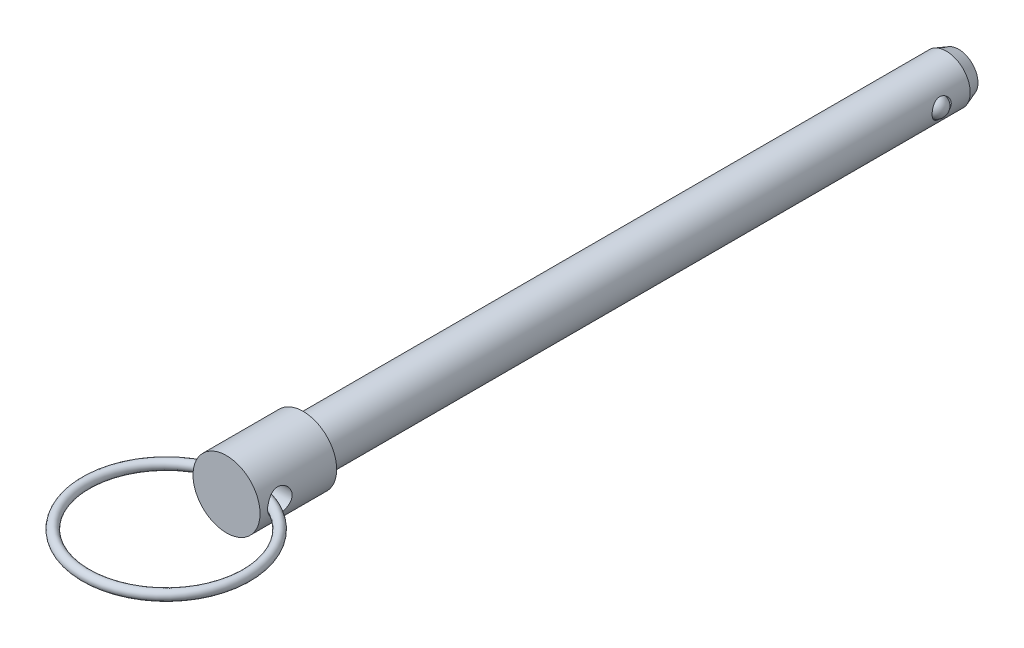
ISO-10303-21;
HEADER;
FILE_DESCRIPTION(('STEP AP214'),'2;1');
FILE_NAME('part.step','',(''),(''),'','','');
FILE_SCHEMA(('AUTOMOTIVE_DESIGN { 1 0 10303 214 1 1 1 1 }'));
ENDSEC;
DATA;
#1=APPLICATION_CONTEXT('core data for automotive mechanical design processes');
#2=APPLICATION_PROTOCOL_DEFINITION('international standard','automotive_design',2000,#1);
#3=PRODUCT_CONTEXT('',#1,'mechanical');
#4=PRODUCT('Part','Part','',(#3));
#5=PRODUCT_RELATED_PRODUCT_CATEGORY('part','',(#4));
#6=PRODUCT_DEFINITION_FORMATION('','',#4);
#7=PRODUCT_DEFINITION_CONTEXT('part definition',#1,'design');
#8=PRODUCT_DEFINITION('design','',#6,#7);
#9=PRODUCT_DEFINITION_SHAPE('','',#8);
#10=(LENGTH_UNIT() NAMED_UNIT(*) SI_UNIT(.MILLI.,.METRE.));
#11=(NAMED_UNIT(*) PLANE_ANGLE_UNIT() SI_UNIT($,.RADIAN.));
#12=(NAMED_UNIT(*) SI_UNIT($,.STERADIAN.) SOLID_ANGLE_UNIT());
#13=UNCERTAINTY_MEASURE_WITH_UNIT(LENGTH_MEASURE(1.E-05),#10,'distance_accuracy_value','');
#14=(GEOMETRIC_REPRESENTATION_CONTEXT(3) GLOBAL_UNCERTAINTY_ASSIGNED_CONTEXT((#13)) GLOBAL_UNIT_ASSIGNED_CONTEXT((#10,
#11,#12)) REPRESENTATION_CONTEXT('',''));
#15=CARTESIAN_POINT('',(0.,0.,0.));
#16=DIRECTION('',(0.,0.,1.));
#17=DIRECTION('',(1.,0.,0.));
#18=AXIS2_PLACEMENT_3D('',#15,#16,#17);
#19=CARTESIAN_POINT('',(7.9375,0.,9.398));
#20=DIRECTION('',(-1.,0.,0.));
#21=DIRECTION('',(0.,0.,-1.));
#22=AXIS2_PLACEMENT_3D('',#19,#20,#21);
#23=CYLINDRICAL_SURFACE('',#22,2.0193);
#24=CARTESIAN_POINT('',(-5.55645,0.413388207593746,11.3745329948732));
#25=CARTESIAN_POINT('',(-5.53323669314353,0.388835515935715,11.3796705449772));
#26=CARTESIAN_POINT('',(-5.51157389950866,0.362641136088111,11.3846690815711));
#27=CARTESIAN_POINT('',(-5.47216390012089,0.307044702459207,11.3940198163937));
#28=CARTESIAN_POINT('',(-5.45444977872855,0.277618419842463,11.3983664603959));
#29=CARTESIAN_POINT('',(-5.42406600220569,0.215851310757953,11.4059720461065));
#30=CARTESIAN_POINT('',(-5.41142802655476,0.18349367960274,11.4092241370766));
#31=CARTESIAN_POINT('',(-5.39235124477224,0.116986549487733,11.4141821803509));
#32=CARTESIAN_POINT('',(-5.38588919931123,0.0828442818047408,11.4158939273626));
#33=CARTESIAN_POINT('',(-5.37995615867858,0.0172985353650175,11.4174656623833));
#34=CARTESIAN_POINT('',(-5.37986165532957,-0.0140451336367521,11.4174908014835));
#35=CARTESIAN_POINT('',(-5.38511249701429,-0.0762532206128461,11.4160995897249));
#36=CARTESIAN_POINT('',(-5.3904604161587,-0.107117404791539,11.4146825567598));
#37=CARTESIAN_POINT('',(-5.40574321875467,-0.165640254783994,11.4106965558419));
#38=CARTESIAN_POINT('',(-5.41539031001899,-0.193380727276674,11.408200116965));
#39=CARTESIAN_POINT('',(-5.4386285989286,-0.247073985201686,11.4023097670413));
#40=CARTESIAN_POINT('',(-5.4522239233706,-0.273024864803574,11.398914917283));
#41=CARTESIAN_POINT('',(-5.48024922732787,-0.318737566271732,11.3920973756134));
#42=CARTESIAN_POINT('',(-5.49418727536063,-0.338820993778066,11.3887682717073));
#43=CARTESIAN_POINT('',(-5.52397071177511,-0.377330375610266,11.3818282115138));
#44=CARTESIAN_POINT('',(-5.53980753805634,-0.395763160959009,11.378218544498));
#45=CARTESIAN_POINT('',(-5.55645,-0.41338820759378,11.3745329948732));
#46=B_SPLINE_CURVE_WITH_KNOTS('',3,(#24,#25,#26,#27,#28,#29,#30,#31,#32,#33,#34,#35,#36,#37,#38,
#39,#40,#41,#42,#43,#44,#45),.UNSPECIFIED.,.F.,.F.,(4,2,2,2,2,2,2,2,2,2,4),(0.,
0.102621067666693,0.206072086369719,0.31015905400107,0.413852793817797,0.507376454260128,
0.600944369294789,0.689017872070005,0.777183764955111,0.851068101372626,0.924630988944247),.UNSPECIFIED.);
#47=CARTESIAN_POINT('',(-5.54200209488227,0.397651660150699,11.3777589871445));
#48=VERTEX_POINT('',#47);
#49=CARTESIAN_POINT('',(-5.54200209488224,-0.397651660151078,11.3777589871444));
#50=VERTEX_POINT('',#49);
#51=EDGE_CURVE('E40',#48,#50,#46,.T.);
#52=ORIENTED_EDGE('',*,*,#51,.F.);
#53=CARTESIAN_POINT('',(-5.55625,0.,11.4173));
#54=CARTESIAN_POINT('',(-5.55624527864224,-0.109432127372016,11.4172937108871));
#55=CARTESIAN_POINT('',(-5.55298237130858,-0.218969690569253,11.408361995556));
#56=CARTESIAN_POINT('',(-5.54026368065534,-0.434902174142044,11.372953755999));
#57=CARTESIAN_POINT('',(-5.53079819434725,-0.541291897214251,11.3464497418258));
#58=CARTESIAN_POINT('',(-5.50670156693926,-0.747605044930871,11.2769560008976));
#59=CARTESIAN_POINT('',(-5.49208344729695,-0.847544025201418,11.2340078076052));
#60=CARTESIAN_POINT('',(-5.45915039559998,-1.0387575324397,11.1330083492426));
#61=CARTESIAN_POINT('',(-5.44083572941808,-1.13003268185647,11.0749581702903));
#62=CARTESIAN_POINT('',(-5.4015811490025,-1.3050572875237,10.9429422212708));
#63=CARTESIAN_POINT('',(-5.38056990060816,-1.38841141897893,10.8684736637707));
#64=CARTESIAN_POINT('',(-5.33865236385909,-1.54176439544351,10.7067995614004));
#65=CARTESIAN_POINT('',(-5.31774611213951,-1.6117588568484,10.6195898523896));
#66=CARTESIAN_POINT('',(-5.27759352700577,-1.73882919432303,10.4311528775));
#67=CARTESIAN_POINT('',(-5.25843183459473,-1.79536185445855,10.3295394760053));
#68=CARTESIAN_POINT('',(-5.22503611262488,-1.89036141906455,10.1174402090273));
#69=CARTESIAN_POINT('',(-5.21080023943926,-1.92883508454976,10.0069576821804));
#70=CARTESIAN_POINT('',(-5.18962447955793,-1.98509166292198,9.78477737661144));
#71=CARTESIAN_POINT('',(-5.18242178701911,-2.00362275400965,9.67329490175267));
#72=CARTESIAN_POINT('',(-5.17535625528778,-2.02180769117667,9.44858805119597));
#73=CARTESIAN_POINT('',(-5.17549061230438,-2.02146874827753,9.33536435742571));
#74=CARTESIAN_POINT('',(-5.18285629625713,-2.00249790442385,9.11709454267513));
#75=CARTESIAN_POINT('',(-5.18969215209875,-1.98488533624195,9.01194405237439));
#76=CARTESIAN_POINT('',(-5.2090363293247,-1.93354575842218,8.80620743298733));
#77=CARTESIAN_POINT('',(-5.22154547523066,-1.89981640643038,8.70562196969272));
#78=CARTESIAN_POINT('',(-5.25107746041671,-1.81661001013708,8.50972358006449));
#79=CARTESIAN_POINT('',(-5.26817827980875,-1.76685762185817,8.41453987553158));
#80=CARTESIAN_POINT('',(-5.30493780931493,-1.65321144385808,8.23357336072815));
#81=CARTESIAN_POINT('',(-5.32459724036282,-1.58931366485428,8.14779321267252));
#82=CARTESIAN_POINT('',(-5.36576425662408,-1.44447059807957,7.98240722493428));
#83=CARTESIAN_POINT('',(-5.38731044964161,-1.36270785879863,7.90352531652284));
#84=CARTESIAN_POINT('',(-5.42876622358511,-1.18682967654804,7.76035905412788));
#85=CARTESIAN_POINT('',(-5.44867505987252,-1.09270866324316,7.69608131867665));
#86=CARTESIAN_POINT('',(-5.48497084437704,-0.893001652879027,7.58320896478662));
#87=CARTESIAN_POINT('',(-5.5013029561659,-0.787270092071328,7.53485348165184));
#88=CARTESIAN_POINT('',(-5.52817729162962,-0.568540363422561,7.45692936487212));
#89=CARTESIAN_POINT('',(-5.53873126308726,-0.455557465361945,7.42732259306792));
#90=CARTESIAN_POINT('',(-5.54924569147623,-0.284581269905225,7.39803699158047));
#91=CARTESIAN_POINT('',(-5.5518636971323,-0.227949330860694,7.3907957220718));
#92=CARTESIAN_POINT('',(-5.55536708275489,-0.114221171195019,7.3811255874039));
#93=CARTESIAN_POINT('',(-5.55625246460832,-0.0571249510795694,7.37869671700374));
#94=CARTESIAN_POINT('',(-5.55624527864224,0.109432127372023,7.37870628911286));
#95=CARTESIAN_POINT('',(-5.55298237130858,0.218969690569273,7.38763800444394));
#96=CARTESIAN_POINT('',(-5.54026368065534,0.434902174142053,7.42304624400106));
#97=CARTESIAN_POINT('',(-5.53079819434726,0.541291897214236,7.44955025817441));
#98=CARTESIAN_POINT('',(-5.50670156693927,0.747605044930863,7.51904399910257));
#99=CARTESIAN_POINT('',(-5.49208344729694,0.84754402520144,7.56199219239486));
#100=CARTESIAN_POINT('',(-5.45915039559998,1.03875753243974,7.66299165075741));
#101=CARTESIAN_POINT('',(-5.44083572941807,1.13003268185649,7.72104182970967));
#102=CARTESIAN_POINT('',(-5.40158114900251,1.30505728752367,7.85305777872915));
#103=CARTESIAN_POINT('',(-5.38056990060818,1.38841141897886,7.92752633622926));
#104=CARTESIAN_POINT('',(-5.3386523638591,1.54176439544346,8.0892004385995));
#105=CARTESIAN_POINT('',(-5.31774611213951,1.61175885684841,8.17641014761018));
#106=CARTESIAN_POINT('',(-5.27759352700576,1.73882919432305,8.36484712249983));
#107=CARTESIAN_POINT('',(-5.25843183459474,1.79536185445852,8.46646052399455));
#108=CARTESIAN_POINT('',(-5.22503611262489,1.8903614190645,8.67855979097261));
#109=CARTESIAN_POINT('',(-5.21080023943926,1.92883508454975,8.78904231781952));
#110=CARTESIAN_POINT('',(-5.18962447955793,1.98509166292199,9.01122262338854));
#111=CARTESIAN_POINT('',(-5.18242178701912,2.00362275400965,9.12270509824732));
#112=CARTESIAN_POINT('',(-5.17535625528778,2.02180769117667,9.34741194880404));
#113=CARTESIAN_POINT('',(-5.17549061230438,2.02146874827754,9.4606356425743));
#114=CARTESIAN_POINT('',(-5.18285629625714,2.00249790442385,9.67890545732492));
#115=CARTESIAN_POINT('',(-5.18969215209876,1.98488533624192,9.78405594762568));
#116=CARTESIAN_POINT('',(-5.20903632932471,1.93354575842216,9.9897925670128));
#117=CARTESIAN_POINT('',(-5.22154547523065,1.8998164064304,10.0903780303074));
#118=CARTESIAN_POINT('',(-5.25107746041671,1.81661001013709,10.2862764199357));
#119=CARTESIAN_POINT('',(-5.26817827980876,1.76685762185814,10.3814601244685));
#120=CARTESIAN_POINT('',(-5.30493780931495,1.65321144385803,10.5624266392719));
#121=CARTESIAN_POINT('',(-5.32459724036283,1.58931366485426,10.6482067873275));
#122=CARTESIAN_POINT('',(-5.36576425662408,1.44447059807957,10.8135927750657));
#123=CARTESIAN_POINT('',(-5.38731044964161,1.36270785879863,10.8924746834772));
#124=CARTESIAN_POINT('',(-5.42876622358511,1.18682967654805,11.0356409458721));
#125=CARTESIAN_POINT('',(-5.44867505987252,1.09270866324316,11.0999186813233));
#126=CARTESIAN_POINT('',(-5.48497084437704,0.893001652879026,11.2127910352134));
#127=CARTESIAN_POINT('',(-5.5013029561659,0.787270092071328,11.2611465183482));
#128=CARTESIAN_POINT('',(-5.52817729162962,0.568540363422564,11.3390706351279));
#129=CARTESIAN_POINT('',(-5.53873126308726,0.455557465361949,11.3686774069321));
#130=CARTESIAN_POINT('',(-5.54924569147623,0.284581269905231,11.3979630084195));
#131=CARTESIAN_POINT('',(-5.5518636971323,0.227949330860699,11.4052042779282));
#132=CARTESIAN_POINT('',(-5.55536708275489,0.114221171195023,11.4148744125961));
#133=CARTESIAN_POINT('',(-5.55625246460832,0.0571249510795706,11.4173032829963));
#134=CARTESIAN_POINT('',(-5.55625,0.,11.4173));
#135=B_SPLINE_CURVE_WITH_KNOTS('',3,(#53,#54,#55,#56,#57,#58,#59,#60,#61,#62,#63,#64,#65,#66,
#67,#68,#69,#70,#71,#72,#73,#74,#75,#76,#77,#78,#79,#80,#81,#82,#83,#84,#85,#86,#87,#88,#89,#90,
#91,#92,#93,#94,#95,#96,#97,#98,#99,#100,#101,#102,#103,#104,#105,#106,#107,#108,#109,#110,#111,
#112,#113,#114,#115,#116,#117,#118,#119,#120,#121,#122,#123,#124,#125,#126,#127,#128,#129,#130,
#131,#132,#133,#134),.UNSPECIFIED.,.T.,.F.,(4,2,2,2,2,2,2,2,2,2,2,2,2,2,2,2,2,2,2,2,2,2,2,2,2,2,
2,2,2,2,2,2,2,2,2,2,2,2,2,2,4),(0.,0.328075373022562,0.656665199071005,0.984430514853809,
1.31217226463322,1.65185430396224,1.99164760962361,2.34343505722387,2.69509069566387,
3.0330365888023,3.3708533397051,3.68986542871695,4.00892389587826,4.3337872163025,
4.65874227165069,5.00406386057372,5.34954163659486,5.69999369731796,6.04973056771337,
6.22099023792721,6.39224972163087,6.72032509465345,7.04891492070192,7.37668023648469,
7.70442198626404,8.044104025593,8.38389733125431,8.73568477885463,9.08734041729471,
9.42528631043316,9.76310306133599,10.0821151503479,10.4011736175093,10.7260369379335,
11.0509919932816,11.3963135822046,11.7417913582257,12.0922434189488,12.4419802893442,
12.6132399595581,12.7844994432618),.UNSPECIFIED.);
#136=EDGE_CURVE('E66',#50,#48,#135,.T.);
#137=ORIENTED_EDGE('',*,*,#136,.F.);
#138=EDGE_LOOP('',(#52,#137));
#139=FACE_BOUND('',#138,.T.);
#140=CARTESIAN_POINT('',(5.55645,-0.413388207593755,11.3745329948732));
#141=CARTESIAN_POINT('',(5.53323669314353,-0.388835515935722,11.3796705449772));
#142=CARTESIAN_POINT('',(5.51157389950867,-0.362641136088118,11.3846690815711));
#143=CARTESIAN_POINT('',(5.47216390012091,-0.307044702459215,11.3940198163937));
#144=CARTESIAN_POINT('',(5.45444977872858,-0.277618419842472,11.3983664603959));
#145=CARTESIAN_POINT('',(5.42406600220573,-0.215851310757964,11.4059720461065));
#146=CARTESIAN_POINT('',(5.41142802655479,-0.183493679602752,11.4092241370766));
#147=CARTESIAN_POINT('',(5.39235124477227,-0.116986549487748,11.4141821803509));
#148=CARTESIAN_POINT('',(5.38588919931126,-0.0828442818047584,11.4158939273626));
#149=CARTESIAN_POINT('',(5.37995615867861,-0.0172985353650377,11.4174656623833));
#150=CARTESIAN_POINT('',(5.3798616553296,0.0140451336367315,11.4174908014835));
#151=CARTESIAN_POINT('',(5.38511249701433,0.0762532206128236,11.4160995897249));
#152=CARTESIAN_POINT('',(5.39046041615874,0.107117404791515,11.4146825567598));
#153=CARTESIAN_POINT('',(5.40574321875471,0.16564025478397,11.4106965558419));
#154=CARTESIAN_POINT('',(5.41539031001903,0.193380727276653,11.408200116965));
#155=CARTESIAN_POINT('',(5.43862859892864,0.247073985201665,11.4023097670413));
#156=CARTESIAN_POINT('',(5.45222392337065,0.273024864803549,11.398914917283));
#157=CARTESIAN_POINT('',(5.48024922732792,0.3187375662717,11.3920973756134));
#158=CARTESIAN_POINT('',(5.49418727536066,0.33882099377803,11.3887682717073));
#159=CARTESIAN_POINT('',(5.52397071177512,0.37733037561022,11.3818282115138));
#160=CARTESIAN_POINT('',(5.53980753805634,0.395763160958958,11.378218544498));
#161=CARTESIAN_POINT('',(5.55645,0.413388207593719,11.3745329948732));
#162=B_SPLINE_CURVE_WITH_KNOTS('',3,(#140,#141,#142,#143,#144,#145,#146,#147,#148,#149,#150,
#151,#152,#153,#154,#155,#156,#157,#158,#159,#160,#161),.UNSPECIFIED.,.F.,.F.,(4,2,2,2,2,2,2,2,
2,2,4),(0.,0.102621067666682,0.2060720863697,0.310159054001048,0.413852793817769,
0.507376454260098,0.600944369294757,0.689017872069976,0.777183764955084,0.85106810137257,
0.924630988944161),.UNSPECIFIED.);
#163=CARTESIAN_POINT('',(5.54200209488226,-0.397651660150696,11.3777589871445));
#164=VERTEX_POINT('',#163);
#165=CARTESIAN_POINT('',(5.54200209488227,0.397651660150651,11.3777589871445));
#166=VERTEX_POINT('',#165);
#167=EDGE_CURVE('E33',#164,#166,#162,.T.);
#168=ORIENTED_EDGE('',*,*,#167,.F.);
#169=CARTESIAN_POINT('',(5.55625,0.,7.3787));
#170=CARTESIAN_POINT('',(5.55624527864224,-0.10943212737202,7.37870628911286));
#171=CARTESIAN_POINT('',(5.55298237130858,-0.218969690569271,7.38763800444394));
#172=CARTESIAN_POINT('',(5.54026368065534,-0.434902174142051,7.42304624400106));
#173=CARTESIAN_POINT('',(5.53079819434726,-0.541291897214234,7.44955025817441));
#174=CARTESIAN_POINT('',(5.50670156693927,-0.747605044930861,7.51904399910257));
#175=CARTESIAN_POINT('',(5.49208344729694,-0.847544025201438,7.56199219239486));
#176=CARTESIAN_POINT('',(5.45915039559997,-1.03875753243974,7.66299165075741));
#177=CARTESIAN_POINT('',(5.44083572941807,-1.13003268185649,7.72104182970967));
#178=CARTESIAN_POINT('',(5.40158114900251,-1.30505728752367,7.85305777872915));
#179=CARTESIAN_POINT('',(5.38056990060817,-1.38841141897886,7.92752633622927));
#180=CARTESIAN_POINT('',(5.3386523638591,-1.54176439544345,8.0892004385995));
#181=CARTESIAN_POINT('',(5.31774611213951,-1.61175885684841,8.17641014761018));
#182=CARTESIAN_POINT('',(5.27759352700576,-1.73882919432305,8.36484712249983));
#183=CARTESIAN_POINT('',(5.25843183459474,-1.79536185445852,8.46646052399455));
#184=CARTESIAN_POINT('',(5.22503611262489,-1.8903614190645,8.67855979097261));
#185=CARTESIAN_POINT('',(5.21080023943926,-1.92883508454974,8.78904231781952));
#186=CARTESIAN_POINT('',(5.18962447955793,-1.98509166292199,9.01122262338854));
#187=CARTESIAN_POINT('',(5.18242178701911,-2.00362275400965,9.12270509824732));
#188=CARTESIAN_POINT('',(5.17535625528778,-2.02180769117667,9.34741194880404));
#189=CARTESIAN_POINT('',(5.17549061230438,-2.02146874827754,9.4606356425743));
#190=CARTESIAN_POINT('',(5.18285629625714,-2.00249790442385,9.67890545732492));
#191=CARTESIAN_POINT('',(5.18969215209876,-1.98488533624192,9.78405594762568));
#192=CARTESIAN_POINT('',(5.20903632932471,-1.93354575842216,9.9897925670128));
#193=CARTESIAN_POINT('',(5.22154547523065,-1.8998164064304,10.0903780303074));
#194=CARTESIAN_POINT('',(5.25107746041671,-1.81661001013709,10.2862764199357));
#195=CARTESIAN_POINT('',(5.26817827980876,-1.76685762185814,10.3814601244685));
#196=CARTESIAN_POINT('',(5.30493780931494,-1.65321144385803,10.5624266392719));
#197=CARTESIAN_POINT('',(5.32459724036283,-1.58931366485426,10.6482067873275));
#198=CARTESIAN_POINT('',(5.36576425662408,-1.44447059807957,10.8135927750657));
#199=CARTESIAN_POINT('',(5.38731044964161,-1.36270785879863,10.8924746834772));
#200=CARTESIAN_POINT('',(5.42876622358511,-1.18682967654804,11.0356409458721));
#201=CARTESIAN_POINT('',(5.44867505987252,-1.09270866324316,11.0999186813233));
#202=CARTESIAN_POINT('',(5.48497084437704,-0.893001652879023,11.2127910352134));
#203=CARTESIAN_POINT('',(5.50130295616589,-0.787270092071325,11.2611465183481));
#204=CARTESIAN_POINT('',(5.52817729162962,-0.568540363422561,11.3390706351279));
#205=CARTESIAN_POINT('',(5.53873126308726,-0.455557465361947,11.3686774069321));
#206=CARTESIAN_POINT('',(5.54924569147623,-0.284581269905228,11.3979630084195));
#207=CARTESIAN_POINT('',(5.5518636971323,-0.227949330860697,11.4052042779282));
#208=CARTESIAN_POINT('',(5.55536708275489,-0.11422117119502,11.4148744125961));
#209=CARTESIAN_POINT('',(5.55625246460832,-0.0571249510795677,11.4173032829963));
#210=CARTESIAN_POINT('',(5.55624527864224,0.109432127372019,11.4172937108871));
#211=CARTESIAN_POINT('',(5.55298237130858,0.218969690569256,11.408361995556));
#212=CARTESIAN_POINT('',(5.54026368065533,0.434902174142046,11.372953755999));
#213=CARTESIAN_POINT('',(5.53079819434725,0.541291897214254,11.3464497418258));
#214=CARTESIAN_POINT('',(5.50670156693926,0.747605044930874,11.2769560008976));
#215=CARTESIAN_POINT('',(5.49208344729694,0.84754402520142,11.2340078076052));
#216=CARTESIAN_POINT('',(5.45915039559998,1.03875753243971,11.1330083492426));
#217=CARTESIAN_POINT('',(5.44083572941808,1.13003268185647,11.0749581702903));
#218=CARTESIAN_POINT('',(5.4015811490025,1.3050572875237,10.9429422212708));
#219=CARTESIAN_POINT('',(5.38056990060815,1.38841141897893,10.8684736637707));
#220=CARTESIAN_POINT('',(5.33865236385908,1.54176439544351,10.7067995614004));
#221=CARTESIAN_POINT('',(5.31774611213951,1.6117588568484,10.6195898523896));
#222=CARTESIAN_POINT('',(5.27759352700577,1.73882919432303,10.4311528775));
#223=CARTESIAN_POINT('',(5.25843183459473,1.79536185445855,10.3295394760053));
#224=CARTESIAN_POINT('',(5.22503611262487,1.89036141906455,10.1174402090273));
#225=CARTESIAN_POINT('',(5.21080023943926,1.92883508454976,10.0069576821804));
#226=CARTESIAN_POINT('',(5.18962447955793,1.98509166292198,9.78477737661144));
#227=CARTESIAN_POINT('',(5.18242178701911,2.00362275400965,9.67329490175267));
#228=CARTESIAN_POINT('',(5.17535625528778,2.02180769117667,9.44858805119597));
#229=CARTESIAN_POINT('',(5.17549061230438,2.02146874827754,9.33536435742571));
#230=CARTESIAN_POINT('',(5.18285629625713,2.00249790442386,9.11709454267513));
#231=CARTESIAN_POINT('',(5.18969215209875,1.98488533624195,9.01194405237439));
#232=CARTESIAN_POINT('',(5.2090363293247,1.93354575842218,8.80620743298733));
#233=CARTESIAN_POINT('',(5.22154547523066,1.89981640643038,8.70562196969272));
#234=CARTESIAN_POINT('',(5.25107746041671,1.81661001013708,8.50972358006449));
#235=CARTESIAN_POINT('',(5.26817827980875,1.76685762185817,8.41453987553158));
#236=CARTESIAN_POINT('',(5.30493780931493,1.65321144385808,8.23357336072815));
#237=CARTESIAN_POINT('',(5.32459724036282,1.58931366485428,8.14779321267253));
#238=CARTESIAN_POINT('',(5.36576425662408,1.44447059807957,7.98240722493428));
#239=CARTESIAN_POINT('',(5.38731044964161,1.36270785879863,7.90352531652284));
#240=CARTESIAN_POINT('',(5.42876622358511,1.18682967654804,7.76035905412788));
#241=CARTESIAN_POINT('',(5.44867505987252,1.09270866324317,7.69608131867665));
#242=CARTESIAN_POINT('',(5.48497084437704,0.893001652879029,7.58320896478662));
#243=CARTESIAN_POINT('',(5.50130295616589,0.787270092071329,7.53485348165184));
#244=CARTESIAN_POINT('',(5.52817729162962,0.568540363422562,7.45692936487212));
#245=CARTESIAN_POINT('',(5.53873126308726,0.455557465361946,7.42732259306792));
#246=CARTESIAN_POINT('',(5.54924569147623,0.284581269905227,7.39803699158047));
#247=CARTESIAN_POINT('',(5.5518636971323,0.227949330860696,7.3907957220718));
#248=CARTESIAN_POINT('',(5.55536708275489,0.114221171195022,7.3811255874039));
#249=CARTESIAN_POINT('',(5.55625246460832,0.057124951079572,7.37869671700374));
#250=CARTESIAN_POINT('',(5.55625,0.,7.3787));
#251=B_SPLINE_CURVE_WITH_KNOTS('',3,(#169,#170,#171,#172,#173,#174,#175,#176,#177,#178,#179,
#180,#181,#182,#183,#184,#185,#186,#187,#188,#189,#190,#191,#192,#193,#194,#195,#196,#197,#198,
#199,#200,#201,#202,#203,#204,#205,#206,#207,#208,#209,#210,#211,#212,#213,#214,#215,#216,#217,
#218,#219,#220,#221,#222,#223,#224,#225,#226,#227,#228,#229,#230,#231,#232,#233,#234,#235,#236,
#237,#238,#239,#240,#241,#242,#243,#244,#245,#246,#247,#248,#249,#250),.UNSPECIFIED.,.T.,.F.,(4,
2,2,2,2,2,2,2,2,2,2,2,2,2,2,2,2,2,2,2,2,2,2,2,2,2,2,2,2,2,2,2,2,2,2,2,2,2,2,2,4),(0.,
0.328075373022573,0.656665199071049,0.984430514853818,1.31217226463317,1.65185430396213,
1.99164760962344,2.34343505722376,2.69509069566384,3.03303658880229,3.37085333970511,
3.68986542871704,4.00892389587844,4.33378721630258,4.65874227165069,5.00406386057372,
5.34954163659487,5.69999369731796,6.04973056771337,6.22099023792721,6.39224972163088,
6.72032509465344,7.04891492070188,7.37668023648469,7.7044219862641,8.04410402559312,
8.38389733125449,8.73568477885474,9.08734041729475,9.42528631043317,9.76310306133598,
10.0821151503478,10.4011736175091,10.7260369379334,11.0509919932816,11.3963135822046,
11.7417913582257,12.0922434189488,12.4419802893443,12.6132399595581,12.7844994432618),.UNSPECIFIED.);
#252=EDGE_CURVE('E62',#166,#164,#251,.T.);
#253=ORIENTED_EDGE('',*,*,#252,.F.);
#254=EDGE_LOOP('',(#168,#253));
#255=FACE_BOUND('',#254,.T.);
#256=ADVANCED_FACE('F14',(#139,#255),#23,.F.);
#257=CARTESIAN_POINT('',(0.,0.,-28.63596));
#258=DIRECTION('',(0.,0.,-1.));
#259=DIRECTION('',(1.,0.,0.));
#260=AXIS2_PLACEMENT_3D('',#257,#258,#259);
#261=CYLINDRICAL_SURFACE('',#260,5.55625);
#262=ORIENTED_EDGE('',*,*,#252,.T.);
#263=CARTESIAN_POINT('',(5.55009347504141,-0.261488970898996,9.78608403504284));
#264=CARTESIAN_POINT('',(5.54812529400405,-0.30325141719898,9.80096224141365));
#265=CARTESIAN_POINT('',(5.5457404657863,-0.343758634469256,9.81942005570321));
#266=CARTESIAN_POINT('',(5.54040847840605,-0.421066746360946,9.86292845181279));
#267=CARTESIAN_POINT('',(5.5374605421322,-0.457862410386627,9.88798816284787));
#268=CARTESIAN_POINT('',(5.53134134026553,-0.526658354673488,9.94386457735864));
#269=CARTESIAN_POINT('',(5.52817046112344,-0.558666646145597,9.97467146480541));
#270=CARTESIAN_POINT('',(5.52194469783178,-0.617178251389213,10.0411137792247));
#271=CARTESIAN_POINT('',(5.51888978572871,-0.643682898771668,10.0767480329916));
#272=CARTESIAN_POINT('',(5.51313628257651,-0.691254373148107,10.1527268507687));
#273=CARTESIAN_POINT('',(5.51044827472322,-0.712171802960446,10.1931655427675));
#274=CARTESIAN_POINT('',(5.50578097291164,-0.747399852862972,10.2768577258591));
#275=CARTESIAN_POINT('',(5.50380188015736,-0.761708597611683,10.3201120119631));
#276=CARTESIAN_POINT('',(5.50062483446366,-0.784334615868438,10.4110491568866));
#277=CARTESIAN_POINT('',(5.4994831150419,-0.792223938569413,10.4588401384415));
#278=CARTESIAN_POINT('',(5.49826873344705,-0.800607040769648,10.5550754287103));
#279=CARTESIAN_POINT('',(5.49819646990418,-0.801098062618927,10.6035199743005));
#280=CARTESIAN_POINT('',(5.49912806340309,-0.794680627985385,10.703944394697));
#281=CARTESIAN_POINT('',(5.50022168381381,-0.787154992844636,10.7558841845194));
#282=CARTESIAN_POINT('',(5.50347103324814,-0.764103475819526,10.8579332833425));
#283=CARTESIAN_POINT('',(5.5056272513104,-0.748573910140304,10.9080417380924));
#284=CARTESIAN_POINT('',(5.51091051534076,-0.708667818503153,11.0082212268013));
#285=CARTESIAN_POINT('',(5.51408971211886,-0.683800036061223,11.0580951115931));
#286=CARTESIAN_POINT('',(5.52096808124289,-0.625839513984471,11.1528267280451));
#287=CARTESIAN_POINT('',(5.52466742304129,-0.59274409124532,11.1976828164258));
#288=CARTESIAN_POINT('',(5.53199718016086,-0.519831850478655,11.2794067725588));
#289=CARTESIAN_POINT('',(5.53562669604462,-0.480224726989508,11.3164602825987));
#290=CARTESIAN_POINT('',(5.54239660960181,-0.394450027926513,11.3820559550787));
#291=CARTESIAN_POINT('',(5.54553772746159,-0.348292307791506,11.4106107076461));
#292=CARTESIAN_POINT('',(5.55042537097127,-0.25776674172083,11.453769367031));
#293=CARTESIAN_POINT('',(5.55230678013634,-0.214079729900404,11.4697807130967));
#294=CARTESIAN_POINT('',(5.55503790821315,-0.124373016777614,11.4927832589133));
#295=CARTESIAN_POINT('',(5.55588906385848,-0.0783566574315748,11.499787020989));
#296=CARTESIAN_POINT('',(5.55638432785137,0.00705853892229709,11.5038718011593));
#297=CARTESIAN_POINT('',(5.55619261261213,0.0463971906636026,11.5023023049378));
#298=CARTESIAN_POINT('',(5.55499790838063,0.124194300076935,11.4923961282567));
#299=CARTESIAN_POINT('',(5.55399500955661,0.162652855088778,11.4840601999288));
#300=CARTESIAN_POINT('',(5.55133569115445,0.236455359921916,11.4614747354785));
#301=CARTESIAN_POINT('',(5.54970019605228,0.271858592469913,11.4474138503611));
#302=CARTESIAN_POINT('',(5.54593788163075,0.340082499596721,11.4140867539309));
#303=CARTESIAN_POINT('',(5.54381093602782,0.37290250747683,11.3948192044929));
#304=CARTESIAN_POINT('',(5.53902830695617,0.438479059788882,11.3497412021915));
#305=CARTESIAN_POINT('',(5.53634134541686,0.47092048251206,11.3234773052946));
#306=CARTESIAN_POINT('',(5.5308403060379,0.531649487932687,11.2665410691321));
#307=CARTESIAN_POINT('',(5.52802616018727,0.55993481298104,11.2358663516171));
#308=CARTESIAN_POINT('',(5.52207389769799,0.616058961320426,11.1660010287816));
#309=CARTESIAN_POINT('',(5.51895184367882,0.643171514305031,11.1262251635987));
#310=CARTESIAN_POINT('',(5.5131400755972,0.691221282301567,11.0430715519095));
#311=CARTESIAN_POINT('',(5.51045062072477,0.712154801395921,10.9996916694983));
#312=CARTESIAN_POINT('',(5.50546631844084,0.749774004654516,10.9047684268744));
#313=CARTESIAN_POINT('',(5.5032620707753,0.765608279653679,10.8528805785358));
#314=CARTESIAN_POINT('',(5.49999925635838,0.788707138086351,10.7471802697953));
#315=CARTESIAN_POINT('',(5.49894104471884,0.795969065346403,10.6933672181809));
#316=CARTESIAN_POINT('',(5.49812737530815,0.801573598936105,10.5836973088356));
#317=CARTESIAN_POINT('',(5.49841008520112,0.799654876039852,10.5278260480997));
#318=CARTESIAN_POINT('',(5.50039129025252,0.785912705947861,10.4173293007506));
#319=CARTESIAN_POINT('',(5.50208922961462,0.774093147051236,10.3627033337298));
#320=CARTESIAN_POINT('',(5.50657222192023,0.741502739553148,10.2600057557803));
#321=CARTESIAN_POINT('',(5.50928213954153,0.721341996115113,10.2117380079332));
#322=CARTESIAN_POINT('',(5.51545799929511,0.672487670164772,10.1197820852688));
#323=CARTESIAN_POINT('',(5.51892350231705,0.64379904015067,10.0760912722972));
#324=CARTESIAN_POINT('',(5.52582601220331,0.581424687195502,9.99852087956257));
#325=CARTESIAN_POINT('',(5.52923968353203,0.548383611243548,9.96412004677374));
#326=CARTESIAN_POINT('',(5.53588272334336,0.476663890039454,9.90178589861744));
#327=CARTESIAN_POINT('',(5.53911216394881,0.437987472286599,9.87385003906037));
#328=CARTESIAN_POINT('',(5.54480401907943,0.358545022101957,9.82683552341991));
#329=CARTESIAN_POINT('',(5.54729992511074,0.318028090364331,9.80733901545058));
#330=CARTESIAN_POINT('',(5.55147034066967,0.234199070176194,9.7755782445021));
#331=CARTESIAN_POINT('',(5.55314476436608,0.190886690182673,9.76331473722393));
#332=CARTESIAN_POINT('',(5.55544526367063,0.103875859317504,9.74662090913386));
#333=CARTESIAN_POINT('',(5.55609634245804,0.0602137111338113,9.74200361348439));
#334=CARTESIAN_POINT('',(5.55635470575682,-0.0272293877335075,9.74015977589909));
#335=CARTESIAN_POINT('',(5.55596342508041,-0.0710100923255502,9.74292307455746));
#336=CARTESIAN_POINT('',(5.55456091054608,-0.139289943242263,9.75303365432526));
#337=CARTESIAN_POINT('',(5.55387840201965,-0.164176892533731,9.75797314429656));
#338=CARTESIAN_POINT('',(5.55220711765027,-0.213342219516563,9.77024669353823));
#339=CARTESIAN_POINT('',(5.55121834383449,-0.237620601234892,9.77758073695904));
#340=CARTESIAN_POINT('',(5.55009347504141,-0.261488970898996,9.78608403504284));
#341=B_SPLINE_CURVE_WITH_KNOTS('',3,(#263,#264,#265,#266,#267,#268,#269,#270,#271,#272,#273,
#274,#275,#276,#277,#278,#279,#280,#281,#282,#283,#284,#285,#286,#287,#288,#289,#290,#291,#292,
#293,#294,#295,#296,#297,#298,#299,#300,#301,#302,#303,#304,#305,#306,#307,#308,#309,#310,#311,
#312,#313,#314,#315,#316,#317,#318,#319,#320,#321,#322,#323,#324,#325,#326,#327,#328,#329,#330,
#331,#332,#333,#334,#335,#336,#337,#338,#339,#340),.UNSPECIFIED.,.T.,.F.,(4,2,2,2,2,2,2,2,2,2,2,
2,2,2,2,2,2,2,2,2,2,2,2,2,2,2,2,2,2,2,2,2,2,2,2,2,2,2,4),(0.,0.133035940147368,0.26625681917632,
0.399252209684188,0.532215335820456,0.668441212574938,0.804705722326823,0.949444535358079,
1.09423729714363,1.25104087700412,1.40791668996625,1.5745741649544,1.74128605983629,
1.90341673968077,2.06530602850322,2.20414603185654,2.34279219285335,2.4603099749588,
2.57781469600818,2.69172579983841,2.80566620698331,2.9306617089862,3.05572486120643,
3.19986521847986,3.34409161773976,3.50624490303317,3.6684484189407,3.83529611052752,
4.00207830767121,4.15836501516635,4.31456113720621,4.4572817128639,4.59994602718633,
4.73438372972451,4.86883547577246,4.99994808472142,5.13088030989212,5.20691445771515,
5.28294810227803),.UNSPECIFIED.);
#342=EDGE_CURVE('E27',#164,#166,#341,.T.);
#343=ORIENTED_EDGE('',*,*,#342,.T.);
#344=EDGE_LOOP('',(#262,#343));
#345=FACE_BOUND('',#344,.T.);
#346=CARTESIAN_POINT('',(0.,0.,-8.28087598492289E-11));
#347=DIRECTION('',(0.,0.,-1.));
#348=DIRECTION('',(1.,0.,0.));
#349=AXIS2_PLACEMENT_3D('',#346,#347,#348);
#350=CIRCLE('',#349,5.55625000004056);
#351=CARTESIAN_POINT('',(5.55625000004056,0.,-8.28090047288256E-11));
#352=VERTEX_POINT('',#351);
#353=EDGE_CURVE('E71',#352,#352,#350,.T.);
#354=ORIENTED_EDGE('',*,*,#353,.F.);
#355=EDGE_LOOP('',(#354));
#356=FACE_BOUND('',#355,.T.);
#357=CARTESIAN_POINT('',(0.,0.,12.7000000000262));
#358=DIRECTION('',(0.,0.,-1.));
#359=DIRECTION('',(1.,0.,0.));
#360=AXIS2_PLACEMENT_3D('',#357,#358,#359);
#361=CIRCLE('',#360,5.55625000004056);
#362=CARTESIAN_POINT('',(5.55625000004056,0.,12.7000000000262));
#363=VERTEX_POINT('',#362);
#364=EDGE_CURVE('E279',#363,#363,#361,.T.);
#365=ORIENTED_EDGE('',*,*,#364,.T.);
#366=EDGE_LOOP('',(#365));
#367=FACE_BOUND('',#366,.T.);
#368=ORIENTED_EDGE('',*,*,#136,.T.);
#369=CARTESIAN_POINT('',(-5.55009347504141,-0.261488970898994,9.78608403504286));
#370=CARTESIAN_POINT('',(-5.55201952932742,-0.220600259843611,9.77152029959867));
#371=CARTESIAN_POINT('',(-5.55354800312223,-0.178464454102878,9.76037150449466));
#372=CARTESIAN_POINT('',(-5.5556384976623,-0.0928868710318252,9.74524129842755));
#373=CARTESIAN_POINT('',(-5.55620009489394,-0.0494445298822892,9.74126302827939));
#374=CARTESIAN_POINT('',(-5.55629347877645,0.0374935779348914,9.74059719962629));
#375=CARTESIAN_POINT('',(-5.55582538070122,0.0809893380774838,9.74390882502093));
#376=CARTESIAN_POINT('',(-5.55391173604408,0.166795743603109,9.75772411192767));
#377=CARTESIAN_POINT('',(-5.5524662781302,0.209106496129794,9.7682271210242));
#378=CARTESIAN_POINT('',(-5.54875885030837,0.291350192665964,9.7961125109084));
#379=CARTESIAN_POINT('',(-5.54649699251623,0.331283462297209,9.81349394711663));
#380=CARTESIAN_POINT('',(-5.54140563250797,0.407683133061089,9.85461863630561));
#381=CARTESIAN_POINT('',(-5.53857612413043,0.444149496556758,9.87836195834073));
#382=CARTESIAN_POINT('',(-5.53262152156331,0.513054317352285,9.93180289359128));
#383=CARTESIAN_POINT('',(-5.52949345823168,0.545442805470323,9.96156453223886));
#384=CARTESIAN_POINT('',(-5.52330278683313,0.604927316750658,10.0259730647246));
#385=CARTESIAN_POINT('',(-5.52024018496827,0.632022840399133,10.0606204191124));
#386=CARTESIAN_POINT('',(-5.51440051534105,0.681126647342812,10.1349305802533));
#387=CARTESIAN_POINT('',(-5.51163525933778,0.702950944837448,10.1747156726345));
#388=CARTESIAN_POINT('',(-5.50677513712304,0.740062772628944,10.2572565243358));
#389=CARTESIAN_POINT('',(-5.50468043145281,0.755348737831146,10.3000129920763));
#390=CARTESIAN_POINT('',(-5.50124315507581,0.780002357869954,10.3899815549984));
#391=CARTESIAN_POINT('',(-5.49995301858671,0.788961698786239,10.4373072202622));
#392=CARTESIAN_POINT('',(-5.498425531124,0.799536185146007,10.5327838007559));
#393=CARTESIAN_POINT('',(-5.49818856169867,0.80114866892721,10.5809350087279));
#394=CARTESIAN_POINT('',(-5.49877665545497,0.797104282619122,10.6808979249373));
#395=CARTESIAN_POINT('',(-5.49969077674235,0.790837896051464,10.732684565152));
#396=CARTESIAN_POINT('',(-5.502598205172,0.7703454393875,10.8346351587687));
#397=CARTESIAN_POINT('',(-5.50459199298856,0.756115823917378,10.8847983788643));
#398=CARTESIAN_POINT('',(-5.50958513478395,0.718862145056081,10.9855133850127));
#399=CARTESIAN_POINT('',(-5.51264228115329,0.695318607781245,11.0358713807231));
#400=CARTESIAN_POINT('',(-5.51933971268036,0.639982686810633,11.1318512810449));
#401=CARTESIAN_POINT('',(-5.5229802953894,0.608186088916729,11.1774707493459));
#402=CARTESIAN_POINT('',(-5.53030695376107,0.537456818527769,11.2614236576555));
#403=CARTESIAN_POINT('',(-5.53399100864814,0.49866394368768,11.2998741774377));
#404=CARTESIAN_POINT('',(-5.54094301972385,0.414294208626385,11.3684444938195));
#405=CARTESIAN_POINT('',(-5.54421186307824,0.368732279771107,11.3985822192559));
#406=CARTESIAN_POINT('',(-5.54902610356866,0.285409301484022,11.4415518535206));
#407=CARTESIAN_POINT('',(-5.55079831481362,0.248931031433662,11.4568629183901));
#408=CARTESIAN_POINT('',(-5.55365405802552,0.173909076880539,11.4812007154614));
#409=CARTESIAN_POINT('',(-5.55473812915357,0.135367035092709,11.4902323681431));
#410=CARTESIAN_POINT('',(-5.55609389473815,0.0571634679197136,11.5014913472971));
#411=CARTESIAN_POINT('',(-5.55636320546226,0.0174989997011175,11.5036987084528));
#412=CARTESIAN_POINT('',(-5.55604928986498,-0.0615987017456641,11.5011080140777));
#413=CARTESIAN_POINT('',(-5.55546601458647,-0.101031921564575,11.4963095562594));
#414=CARTESIAN_POINT('',(-5.5535635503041,-0.176675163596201,11.4803936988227));
#415=CARTESIAN_POINT('',(-5.55227928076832,-0.212950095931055,11.4695756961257));
#416=CARTESIAN_POINT('',(-5.54913333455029,-0.283330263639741,11.4424161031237));
#417=CARTESIAN_POINT('',(-5.54727154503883,-0.317435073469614,11.4260734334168));
#418=CARTESIAN_POINT('',(-5.54300097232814,-0.385072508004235,11.3872975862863));
#419=CARTESIAN_POINT('',(-5.54056357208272,-0.418407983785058,11.3645254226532));
#420=CARTESIAN_POINT('',(-5.53544762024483,-0.481387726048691,11.3143838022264));
#421=CARTESIAN_POINT('',(-5.53276895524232,-0.511030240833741,11.2870121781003));
#422=CARTESIAN_POINT('',(-5.52699292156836,-0.570330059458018,11.2242365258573));
#423=CARTESIAN_POINT('',(-5.52389129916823,-0.599362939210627,11.1882432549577));
#424=CARTESIAN_POINT('',(-5.51794192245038,-0.651866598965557,11.1123875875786));
#425=CARTESIAN_POINT('',(-5.51509432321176,-0.675333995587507,11.0725228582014));
#426=CARTESIAN_POINT('',(-5.50953849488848,-0.719347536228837,10.984054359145));
#427=CARTESIAN_POINT('',(-5.50690598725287,-0.739020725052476,10.9350095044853));
#428=CARTESIAN_POINT('',(-5.50259788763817,-0.770442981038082,10.8343900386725));
#429=CARTESIAN_POINT('',(-5.50092272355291,-0.782188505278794,10.7828143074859));
#430=CARTESIAN_POINT('',(-5.49868146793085,-0.797800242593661,10.6753545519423));
#431=CARTESIAN_POINT('',(-5.49818587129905,-0.801166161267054,10.6193948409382));
#432=CARTESIAN_POINT('',(-5.49862892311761,-0.798121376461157,10.5077343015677));
#433=CARTESIAN_POINT('',(-5.49956724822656,-0.791712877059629,10.4520334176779));
#434=CARTESIAN_POINT('',(-5.50274081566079,-0.769336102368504,10.3451160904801));
#435=CARTESIAN_POINT('',(-5.50491833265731,-0.753792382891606,10.2938098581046));
#436=CARTESIAN_POINT('',(-5.51027934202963,-0.713544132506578,10.1949693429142));
#437=CARTESIAN_POINT('',(-5.51346234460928,-0.6888440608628,10.1474332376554));
#438=CARTESIAN_POINT('',(-5.52010275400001,-0.633315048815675,10.061915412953));
#439=CARTESIAN_POINT('',(-5.52351228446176,-0.603205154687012,10.0234624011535));
#440=CARTESIAN_POINT('',(-5.53038590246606,-0.536527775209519,9.95266893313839));
#441=CARTESIAN_POINT('',(-5.53384993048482,-0.499966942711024,9.92032224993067));
#442=CARTESIAN_POINT('',(-5.53964550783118,-0.430319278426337,9.86936528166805));
#443=CARTESIAN_POINT('',(-5.54205683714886,-0.398291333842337,9.8493012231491));
#444=CARTESIAN_POINT('',(-5.54644342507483,-0.331652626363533,9.81399262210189));
#445=CARTESIAN_POINT('',(-5.54841874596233,-0.297042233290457,9.79874739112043));
#446=CARTESIAN_POINT('',(-5.55009347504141,-0.261488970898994,9.78608403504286));
#447=B_SPLINE_CURVE_WITH_KNOTS('',3,(#369,#370,#371,#372,#373,#374,#375,#376,#377,#378,#379,
#380,#381,#382,#383,#384,#385,#386,#387,#388,#389,#390,#391,#392,#393,#394,#395,#396,#397,#398,
#399,#400,#401,#402,#403,#404,#405,#406,#407,#408,#409,#410,#411,#412,#413,#414,#415,#416,#417,
#418,#419,#420,#421,#422,#423,#424,#425,#426,#427,#428,#429,#430,#431,#432,#433,#434,#435,#436,
#437,#438,#439,#440,#441,#442,#443,#444,#445,#446),.UNSPECIFIED.,.T.,.F.,(4,2,2,2,2,2,2,2,2,2,2,
2,2,2,2,2,2,2,2,2,2,2,2,2,2,2,2,2,2,2,2,2,2,2,2,2,2,2,4),(0.,0.130208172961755,
0.260473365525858,0.390723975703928,0.520962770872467,0.65118368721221,0.781406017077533,
0.913094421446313,1.04479524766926,1.18058351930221,1.31640427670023,1.46034248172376,
1.60433282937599,1.76017982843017,1.91609626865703,2.08232629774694,2.24864137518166,
2.41194177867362,2.57488717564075,2.69318920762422,2.81139843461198,2.92995317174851,
3.04851471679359,3.16164747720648,3.27480235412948,3.39566347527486,3.51658170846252,
3.65508000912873,3.79366229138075,3.95170470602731,4.1098177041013,4.27716593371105,
4.44447643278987,4.6045655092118,4.76457672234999,4.91068415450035,5.05664177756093,
5.16987565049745,5.28309333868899),.UNSPECIFIED.);
#448=EDGE_CURVE('E9',#48,#50,#447,.T.);
#449=ORIENTED_EDGE('',*,*,#448,.T.);
#450=EDGE_LOOP('',(#368,#449));
#451=FACE_BOUND('',#450,.T.);
#452=ADVANCED_FACE('F64',(#345,#356,#367,#451),#261,.T.);
#453=CARTESIAN_POINT('',(0.,0.,-80.));
#454=DIRECTION('',(0.,0.,1.));
#455=DIRECTION('',(-0.810321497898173,-0.585985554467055,0.));
#456=AXIS2_PLACEMENT_3D('',#453,#454,#455);
#457=CYLINDRICAL_SURFACE('',#456,3.95605);
#458=CARTESIAN_POINT('',(0.,0.,0.));
#459=DIRECTION('',(0.,0.,-1.));
#460=DIRECTION('',(0.810321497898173,0.585985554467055,0.));
#461=AXIS2_PLACEMENT_3D('',#458,#459,#460);
#462=CIRCLE('',#461,3.95605);
#463=CARTESIAN_POINT('',(3.20567236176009,2.3181881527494,0.));
#464=VERTEX_POINT('',#463);
#465=EDGE_CURVE('E60',#464,#464,#462,.T.);
#466=ORIENTED_EDGE('',*,*,#465,.T.);
#467=EDGE_LOOP('',(#466));
#468=FACE_BOUND('',#467,.T.);
#469=CARTESIAN_POINT('',(3.95605,0.,-100.29206));
#470=CARTESIAN_POINT('',(3.95604605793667,0.0853977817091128,-100.292064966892));
#471=CARTESIAN_POINT('',(3.95325565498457,0.170869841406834,-100.298984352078));
#472=CARTESIAN_POINT('',(3.94237747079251,0.339330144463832,-100.32639650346));
#473=CARTESIAN_POINT('',(3.93428211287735,0.422314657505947,-100.346908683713));
#474=CARTESIAN_POINT('',(3.91366462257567,0.583199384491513,-100.400639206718));
#475=CARTESIAN_POINT('',(3.9011549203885,0.661113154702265,-100.433821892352));
#476=CARTESIAN_POINT('',(3.87293592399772,0.810225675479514,-100.511797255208));
#477=CARTESIAN_POINT('',(3.85722666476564,0.881424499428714,-100.556589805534));
#478=CARTESIAN_POINT('',(3.82336924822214,1.01851810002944,-100.658742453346));
#479=CARTESIAN_POINT('',(3.8051452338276,1.0840528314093,-100.716560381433));
#480=CARTESIAN_POINT('',(3.76865795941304,1.20479657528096,-100.842152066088));
#481=CARTESIAN_POINT('',(3.75039468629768,1.26000131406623,-100.909929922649));
#482=CARTESIAN_POINT('',(3.71498321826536,1.36096514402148,-101.057214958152));
#483=CARTESIAN_POINT('',(3.69792187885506,1.40618899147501,-101.137112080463));
#484=CARTESIAN_POINT('',(3.66804079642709,1.48239548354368,-101.30416698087));
#485=CARTESIAN_POINT('',(3.65521908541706,1.51338473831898,-101.391321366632));
#486=CARTESIAN_POINT('',(3.63608657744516,1.55877880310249,-101.566266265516));
#487=CARTESIAN_POINT('',(3.62950564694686,1.57387516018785,-101.653846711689));
#488=CARTESIAN_POINT('',(3.62281725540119,1.58921493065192,-101.830525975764));
#489=CARTESIAN_POINT('',(3.62270658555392,1.58946570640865,-101.919624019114));
#490=CARTESIAN_POINT('',(3.62874096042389,1.5756309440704,-102.090146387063));
#491=CARTESIAN_POINT('',(3.63444787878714,1.56254948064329,-102.171670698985));
#492=CARTESIAN_POINT('',(3.65073868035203,1.52409646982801,-102.33125154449));
#493=CARTESIAN_POINT('',(3.66132342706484,1.49872274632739,-102.409307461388));
#494=CARTESIAN_POINT('',(3.68641045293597,1.43592091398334,-102.561627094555));
#495=CARTESIAN_POINT('',(3.70098859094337,1.39825636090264,-102.635780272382));
#496=CARTESIAN_POINT('',(3.73239843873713,1.31210960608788,-102.776984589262));
#497=CARTESIAN_POINT('',(3.74923090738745,1.26362375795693,-102.844033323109));
#498=CARTESIAN_POINT('',(3.78484685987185,1.15278197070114,-102.974613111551));
#499=CARTESIAN_POINT('',(3.8036803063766,1.0896409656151,-103.037465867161));
#500=CARTESIAN_POINT('',(3.84007052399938,0.95349379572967,-103.151926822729));
#501=CARTESIAN_POINT('',(3.85762667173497,0.880482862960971,-103.203529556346));
#502=CARTESIAN_POINT('',(3.88993279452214,0.724712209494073,-103.29492926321));
#503=CARTESIAN_POINT('',(3.90461743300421,0.641782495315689,-103.334460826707));
#504=CARTESIAN_POINT('',(3.92901118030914,0.469788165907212,-103.398719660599));
#505=CARTESIAN_POINT('',(3.93873025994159,0.380736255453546,-103.42347661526));
#506=CARTESIAN_POINT('',(3.94891240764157,0.242349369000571,-103.449206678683));
#507=CARTESIAN_POINT('',(3.95157915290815,0.194170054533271,-103.455890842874));
#508=CARTESIAN_POINT('',(3.95514906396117,0.0973352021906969,-103.464818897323));
#509=CARTESIAN_POINT('',(3.95605224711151,0.0486796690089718,-103.467062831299));
#510=CARTESIAN_POINT('',(3.95604605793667,-0.0853977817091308,-103.467055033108));
#511=CARTESIAN_POINT('',(3.95325565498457,-0.170869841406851,-103.460135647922));
#512=CARTESIAN_POINT('',(3.94237747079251,-0.33933014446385,-103.43272349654));
#513=CARTESIAN_POINT('',(3.93428211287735,-0.422314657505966,-103.412211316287));
#514=CARTESIAN_POINT('',(3.91366462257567,-0.58319938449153,-103.358480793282));
#515=CARTESIAN_POINT('',(3.9011549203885,-0.661113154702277,-103.325298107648));
#516=CARTESIAN_POINT('',(3.87293592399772,-0.810225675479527,-103.247322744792));
#517=CARTESIAN_POINT('',(3.85722666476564,-0.881424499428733,-103.202530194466));
#518=CARTESIAN_POINT('',(3.82336924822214,-1.01851810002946,-103.100377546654));
#519=CARTESIAN_POINT('',(3.8051452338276,-1.08405283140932,-103.042559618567));
#520=CARTESIAN_POINT('',(3.76865795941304,-1.20479657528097,-102.916967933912));
#521=CARTESIAN_POINT('',(3.75039468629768,-1.26000131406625,-102.849190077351));
#522=CARTESIAN_POINT('',(3.71498321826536,-1.36096514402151,-102.701905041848));
#523=CARTESIAN_POINT('',(3.69792187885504,-1.40618899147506,-102.622007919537));
#524=CARTESIAN_POINT('',(3.66804079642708,-1.48239548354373,-102.45495301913));
#525=CARTESIAN_POINT('',(3.65521908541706,-1.513384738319,-102.367798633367));
#526=CARTESIAN_POINT('',(3.63608657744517,-1.55877880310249,-102.192853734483));
#527=CARTESIAN_POINT('',(3.62950564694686,-1.57387516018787,-102.105273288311));
#528=CARTESIAN_POINT('',(3.62281725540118,-1.58921493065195,-101.928594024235));
#529=CARTESIAN_POINT('',(3.62270658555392,-1.58946570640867,-101.839495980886));
#530=CARTESIAN_POINT('',(3.62874096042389,-1.57563094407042,-101.668973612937));
#531=CARTESIAN_POINT('',(3.63444787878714,-1.56254948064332,-101.587449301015));
#532=CARTESIAN_POINT('',(3.65073868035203,-1.52409646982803,-101.42786845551));
#533=CARTESIAN_POINT('',(3.66132342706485,-1.49872274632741,-101.349812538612));
#534=CARTESIAN_POINT('',(3.68641045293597,-1.43592091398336,-101.197492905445));
#535=CARTESIAN_POINT('',(3.70098859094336,-1.39825636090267,-101.123339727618));
#536=CARTESIAN_POINT('',(3.73239843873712,-1.31210960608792,-100.982135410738));
#537=CARTESIAN_POINT('',(3.74923090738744,-1.26362375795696,-100.915086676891));
#538=CARTESIAN_POINT('',(3.78484685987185,-1.15278197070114,-100.784506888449));
#539=CARTESIAN_POINT('',(3.80368030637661,-1.08964096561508,-100.721654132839));
#540=CARTESIAN_POINT('',(3.84007052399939,-0.953493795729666,-100.607193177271));
#541=CARTESIAN_POINT('',(3.85762667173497,-0.880482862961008,-100.555590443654));
#542=CARTESIAN_POINT('',(3.88993279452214,-0.724712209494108,-100.46419073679));
#543=CARTESIAN_POINT('',(3.90461743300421,-0.641782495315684,-100.424659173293));
#544=CARTESIAN_POINT('',(3.92901118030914,-0.469788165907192,-100.360400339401));
#545=CARTESIAN_POINT('',(3.93873025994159,-0.380736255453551,-100.33564338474));
#546=CARTESIAN_POINT('',(3.94891240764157,-0.242349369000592,-100.309913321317));
#547=CARTESIAN_POINT('',(3.95157915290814,-0.19417005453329,-100.303229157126));
#548=CARTESIAN_POINT('',(3.95514906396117,-0.0973352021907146,-100.294301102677));
#549=CARTESIAN_POINT('',(3.95605224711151,-0.0486796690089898,-100.292057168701));
#550=CARTESIAN_POINT('',(3.95605,0.,-100.29206));
#551=B_SPLINE_CURVE_WITH_KNOTS('',3,(#469,#470,#471,#472,#473,#474,#475,#476,#477,#478,#479,
#480,#481,#482,#483,#484,#485,#486,#487,#488,#489,#490,#491,#492,#493,#494,#495,#496,#497,#498,
#499,#500,#501,#502,#503,#504,#505,#506,#507,#508,#509,#510,#511,#512,#513,#514,#515,#516,#517,
#518,#519,#520,#521,#522,#523,#524,#525,#526,#527,#528,#529,#530,#531,#532,#533,#534,#535,#536,
#537,#538,#539,#540,#541,#542,#543,#544,#545,#546,#547,#548,#549,#550),.UNSPECIFIED.,.T.,.F.,(4,
2,2,2,2,2,2,2,2,2,2,2,2,2,2,2,2,2,2,2,2,2,2,2,2,2,2,2,2,2,2,2,2,2,2,2,2,2,2,2,4),(0.,
0.256004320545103,0.51237507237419,0.768029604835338,1.02368134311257,1.2903333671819,
1.55709546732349,1.83583223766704,2.1144394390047,2.38034753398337,2.64612375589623,
2.89326290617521,3.14044582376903,3.39269582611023,3.64503095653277,3.91697583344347,
4.18905255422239,4.4667401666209,4.74386797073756,4.88980066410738,5.0357319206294,
5.2917362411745,5.54810699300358,5.80376152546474,6.05941326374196,6.32606528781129,
6.59282738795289,6.87156415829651,7.15017135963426,7.41607945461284,7.6818556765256,
7.9289948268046,8.1761777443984,8.42842774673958,8.68076287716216,8.95270775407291,
9.22478447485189,9.50247208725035,9.77959989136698,9.9255325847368,10.0714638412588),.UNSPECIFIED.);
#552=CARTESIAN_POINT('',(3.95605,0.,-100.29206));
#553=VERTEX_POINT('',#552);
#554=EDGE_CURVE('E132',#553,#553,#551,.T.);
#555=ORIENTED_EDGE('',*,*,#554,.T.);
#556=EDGE_LOOP('',(#555));
#557=FACE_BOUND('',#556,.T.);
#558=CARTESIAN_POINT('',(0.,0.,-106.60396));
#559=DIRECTION('',(0.,0.,-1.));
#560=DIRECTION('',(-1.,0.,0.));
#561=AXIS2_PLACEMENT_3D('',#558,#559,#560);
#562=CIRCLE('',#561,3.95605);
#563=CARTESIAN_POINT('',(-3.95604999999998,0.,-106.60396));
#564=VERTEX_POINT('',#563);
#565=EDGE_CURVE('E117',#564,#564,#562,.F.);
#566=ORIENTED_EDGE('',*,*,#565,.T.);
#567=EDGE_LOOP('',(#566));
#568=FACE_BOUND('',#567,.T.);
#569=CARTESIAN_POINT('',(-3.95605,0.,-103.46706));
#570=CARTESIAN_POINT('',(-3.95604605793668,0.0853977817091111,-103.467055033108));
#571=CARTESIAN_POINT('',(-3.95325565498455,0.17086984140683,-103.460135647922));
#572=CARTESIAN_POINT('',(-3.94237747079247,0.339330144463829,-103.43272349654));
#573=CARTESIAN_POINT('',(-3.93428211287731,0.422314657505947,-103.412211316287));
#574=CARTESIAN_POINT('',(-3.91366462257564,0.583199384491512,-103.358480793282));
#575=CARTESIAN_POINT('',(-3.90115492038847,0.661113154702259,-103.325298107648));
#576=CARTESIAN_POINT('',(-3.87293592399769,0.810225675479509,-103.247322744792));
#577=CARTESIAN_POINT('',(-3.85722666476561,0.881424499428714,-103.202530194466));
#578=CARTESIAN_POINT('',(-3.8233692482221,1.01851810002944,-103.100377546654));
#579=CARTESIAN_POINT('',(-3.80514523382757,1.0840528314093,-103.042559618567));
#580=CARTESIAN_POINT('',(-3.76865795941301,1.20479657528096,-102.916967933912));
#581=CARTESIAN_POINT('',(-3.75039468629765,1.26000131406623,-102.849190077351));
#582=CARTESIAN_POINT('',(-3.71498321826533,1.3609651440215,-102.701905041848));
#583=CARTESIAN_POINT('',(-3.69792187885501,1.40618899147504,-102.622007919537));
#584=CARTESIAN_POINT('',(-3.66804079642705,1.48239548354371,-102.45495301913));
#585=CARTESIAN_POINT('',(-3.65521908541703,1.51338473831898,-102.367798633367));
#586=CARTESIAN_POINT('',(-3.63608657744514,1.55877880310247,-102.192853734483));
#587=CARTESIAN_POINT('',(-3.62950564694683,1.57387516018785,-102.105273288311));
#588=CARTESIAN_POINT('',(-3.62281725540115,1.58921493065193,-101.928594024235));
#589=CARTESIAN_POINT('',(-3.62270658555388,1.58946570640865,-101.839495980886));
#590=CARTESIAN_POINT('',(-3.62874096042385,1.5756309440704,-101.668973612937));
#591=CARTESIAN_POINT('',(-3.63444787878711,1.5625494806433,-101.587449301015));
#592=CARTESIAN_POINT('',(-3.650738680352,1.52409646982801,-101.42786845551));
#593=CARTESIAN_POINT('',(-3.66132342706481,1.49872274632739,-101.349812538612));
#594=CARTESIAN_POINT('',(-3.68641045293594,1.43592091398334,-101.197492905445));
#595=CARTESIAN_POINT('',(-3.70098859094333,1.39825636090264,-101.123339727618));
#596=CARTESIAN_POINT('',(-3.73239843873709,1.31210960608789,-100.982135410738));
#597=CARTESIAN_POINT('',(-3.74923090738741,1.26362375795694,-100.915086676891));
#598=CARTESIAN_POINT('',(-3.78484685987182,1.15278197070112,-100.784506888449));
#599=CARTESIAN_POINT('',(-3.80368030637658,1.08964096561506,-100.721654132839));
#600=CARTESIAN_POINT('',(-3.84007052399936,0.953493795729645,-100.607193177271));
#601=CARTESIAN_POINT('',(-3.85762667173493,0.880482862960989,-100.555590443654));
#602=CARTESIAN_POINT('',(-3.8899327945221,0.724712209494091,-100.46419073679));
#603=CARTESIAN_POINT('',(-3.90461743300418,0.641782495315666,-100.424659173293));
#604=CARTESIAN_POINT('',(-3.92901118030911,0.469788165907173,-100.360400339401));
#605=CARTESIAN_POINT('',(-3.93873025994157,0.380736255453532,-100.33564338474));
#606=CARTESIAN_POINT('',(-3.94891240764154,0.242349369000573,-100.309913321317));
#607=CARTESIAN_POINT('',(-3.95157915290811,0.19417005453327,-100.303229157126));
#608=CARTESIAN_POINT('',(-3.95514906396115,0.0973352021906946,-100.294301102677));
#609=CARTESIAN_POINT('',(-3.95605224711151,0.0486796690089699,-100.292057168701));
#610=CARTESIAN_POINT('',(-3.95604605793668,-0.0853977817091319,-100.292064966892));
#611=CARTESIAN_POINT('',(-3.95325565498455,-0.170869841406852,-100.298984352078));
#612=CARTESIAN_POINT('',(-3.94237747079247,-0.33933014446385,-100.32639650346));
#613=CARTESIAN_POINT('',(-3.93428211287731,-0.422314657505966,-100.346908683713));
#614=CARTESIAN_POINT('',(-3.91366462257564,-0.583199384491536,-100.400639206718));
#615=CARTESIAN_POINT('',(-3.90115492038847,-0.661113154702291,-100.433821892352));
#616=CARTESIAN_POINT('',(-3.87293592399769,-0.810225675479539,-100.511797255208));
#617=CARTESIAN_POINT('',(-3.85722666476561,-0.881424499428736,-100.556589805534));
#618=CARTESIAN_POINT('',(-3.8233692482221,-1.01851810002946,-100.658742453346));
#619=CARTESIAN_POINT('',(-3.80514523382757,-1.08405283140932,-100.716560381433));
#620=CARTESIAN_POINT('',(-3.76865795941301,-1.20479657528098,-100.842152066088));
#621=CARTESIAN_POINT('',(-3.75039468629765,-1.26000131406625,-100.909929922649));
#622=CARTESIAN_POINT('',(-3.71498321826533,-1.3609651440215,-101.057214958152));
#623=CARTESIAN_POINT('',(-3.69792187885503,-1.40618899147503,-101.137112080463));
#624=CARTESIAN_POINT('',(-3.66804079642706,-1.4823954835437,-101.30416698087));
#625=CARTESIAN_POINT('',(-3.65521908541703,-1.513384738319,-101.391321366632));
#626=CARTESIAN_POINT('',(-3.63608657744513,-1.55877880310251,-101.566266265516));
#627=CARTESIAN_POINT('',(-3.62950564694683,-1.57387516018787,-101.653846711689));
#628=CARTESIAN_POINT('',(-3.62281725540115,-1.58921493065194,-101.830525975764));
#629=CARTESIAN_POINT('',(-3.62270658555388,-1.58946570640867,-101.919624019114));
#630=CARTESIAN_POINT('',(-3.62874096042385,-1.57563094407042,-102.090146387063));
#631=CARTESIAN_POINT('',(-3.63444787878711,-1.56254948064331,-102.171670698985));
#632=CARTESIAN_POINT('',(-3.650738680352,-1.52409646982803,-102.33125154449));
#633=CARTESIAN_POINT('',(-3.66132342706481,-1.49872274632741,-102.409307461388));
#634=CARTESIAN_POINT('',(-3.68641045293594,-1.43592091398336,-102.561627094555));
#635=CARTESIAN_POINT('',(-3.70098859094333,-1.39825636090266,-102.635780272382));
#636=CARTESIAN_POINT('',(-3.7323984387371,-1.3121096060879,-102.776984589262));
#637=CARTESIAN_POINT('',(-3.74923090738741,-1.26362375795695,-102.844033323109));
#638=CARTESIAN_POINT('',(-3.78484685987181,-1.15278197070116,-102.974613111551));
#639=CARTESIAN_POINT('',(-3.80368030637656,-1.08964096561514,-103.037465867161));
#640=CARTESIAN_POINT('',(-3.84007052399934,-0.953493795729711,-103.151926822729));
#641=CARTESIAN_POINT('',(-3.85762667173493,-0.880482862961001,-103.203529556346));
#642=CARTESIAN_POINT('',(-3.88993279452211,-0.724712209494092,-103.29492926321));
#643=CARTESIAN_POINT('',(-3.90461743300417,-0.641782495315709,-103.334460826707));
#644=CARTESIAN_POINT('',(-3.92901118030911,-0.469788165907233,-103.398719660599));
#645=CARTESIAN_POINT('',(-3.93873025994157,-0.380736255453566,-103.42347661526));
#646=CARTESIAN_POINT('',(-3.94891240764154,-0.242349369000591,-103.449206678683));
#647=CARTESIAN_POINT('',(-3.95157915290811,-0.19417005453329,-103.455890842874));
#648=CARTESIAN_POINT('',(-3.95514906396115,-0.0973352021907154,-103.464818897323));
#649=CARTESIAN_POINT('',(-3.9560522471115,-0.0486796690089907,-103.467062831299));
#650=CARTESIAN_POINT('',(-3.95605,0.,-103.46706));
#651=B_SPLINE_CURVE_WITH_KNOTS('',3,(#569,#570,#571,#572,#573,#574,#575,#576,#577,#578,#579,
#580,#581,#582,#583,#584,#585,#586,#587,#588,#589,#590,#591,#592,#593,#594,#595,#596,#597,#598,
#599,#600,#601,#602,#603,#604,#605,#606,#607,#608,#609,#610,#611,#612,#613,#614,#615,#616,#617,
#618,#619,#620,#621,#622,#623,#624,#625,#626,#627,#628,#629,#630,#631,#632,#633,#634,#635,#636,
#637,#638,#639,#640,#641,#642,#643,#644,#645,#646,#647,#648,#649,#650),.UNSPECIFIED.,.T.,.F.,(4,
2,2,2,2,2,2,2,2,2,2,2,2,2,2,2,2,2,2,2,2,2,2,2,2,2,2,2,2,2,2,2,2,2,2,2,2,2,2,2,4),(0.,
0.256004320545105,0.51237507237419,0.768029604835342,1.02368134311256,1.29033336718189,
1.55709546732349,1.83583223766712,2.11443943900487,2.38034753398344,2.64612375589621,
2.8932629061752,3.14044582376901,3.3926958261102,3.64503095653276,3.9169758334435,
4.18905255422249,4.46674016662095,4.74386797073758,4.8898006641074,5.03573192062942,
5.29173624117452,5.5481069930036,5.80376152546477,6.05941326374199,6.32606528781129,
6.59282738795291,6.87156415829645,7.15017135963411,7.41607945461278,7.68185567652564,
7.92899482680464,8.17617774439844,8.42842774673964,8.68076287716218,8.95270775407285,
9.22478447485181,9.50247208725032,9.77959989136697,9.9255325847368,10.0714638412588),.UNSPECIFIED.);
#652=CARTESIAN_POINT('',(-3.95605,0.,-103.46706));
#653=VERTEX_POINT('',#652);
#654=EDGE_CURVE('E141',#653,#653,#651,.T.);
#655=ORIENTED_EDGE('',*,*,#654,.T.);
#656=EDGE_LOOP('',(#655));
#657=FACE_BOUND('',#656,.T.);
#658=ADVANCED_FACE('F16',(#468,#557,#568,#657),#457,.T.);
#659=CARTESIAN_POINT('',(0.,-5.30225,12.7));
#660=DIRECTION('',(0.,0.,1.));
#661=DIRECTION('',(-1.,0.,0.));
#662=AXIS2_PLACEMENT_3D('',#659,#660,#661);
#663=PLANE('',#662);
#664=ORIENTED_EDGE('',*,*,#364,.F.);
#665=EDGE_LOOP('',(#664));
#666=FACE_BOUND('',#665,.T.);
#667=ADVANCED_FACE('F150',(#666),#663,.T.);
#668=CARTESIAN_POINT('',(0.,-3.95605,0.));
#669=DIRECTION('',(0.,0.,-1.));
#670=DIRECTION('',(1.,0.,0.));
#671=AXIS2_PLACEMENT_3D('',#668,#669,#670);
#672=PLANE('',#671);
#673=ORIENTED_EDGE('',*,*,#353,.T.);
#674=EDGE_LOOP('',(#673));
#675=FACE_BOUND('',#674,.T.);
#676=ORIENTED_EDGE('',*,*,#465,.F.);
#677=EDGE_LOOP('',(#676));
#678=FACE_BOUND('',#677,.T.);
#679=ADVANCED_FACE('F86',(#675,#678),#672,.T.);
#680=CARTESIAN_POINT('',(-3.0861,0.,-101.87956));
#681=DIRECTION('',(0.,0.,-1.));
#682=DIRECTION('',(1.,0.,0.));
#683=AXIS2_PLACEMENT_3D('',#680,#681,#682);
#684=SPHERICAL_SURFACE('',#683,1.5875);
#685=CARTESIAN_POINT('',(-3.0861,0.,-101.87956));
#686=DIRECTION('',(1.,0.,0.));
#687=DIRECTION('',(0.,0.,-1.));
#688=AXIS2_PLACEMENT_3D('',#685,#686,#687);
#689=CIRCLE('',#688,1.5875);
#690=CARTESIAN_POINT('',(-3.0861,0.,-103.46706));
#691=VERTEX_POINT('',#690);
#692=CARTESIAN_POINT('',(-3.0861,0.,-100.29206));
#693=VERTEX_POINT('',#692);
#694=EDGE_CURVE('E112',#691,#693,#689,.F.);
#695=ORIENTED_EDGE('',*,*,#694,.T.);
#696=CARTESIAN_POINT('',(-3.0861,0.,-101.87956));
#697=DIRECTION('',(1.,0.,0.));
#698=DIRECTION('',(0.,0.,-1.));
#699=AXIS2_PLACEMENT_3D('',#696,#697,#698);
#700=CIRCLE('',#699,1.5875);
#701=EDGE_CURVE('E140',#693,#691,#700,.F.);
#702=ORIENTED_EDGE('',*,*,#701,.T.);
#703=EDGE_LOOP('',(#695,#702));
#704=FACE_BOUND('',#703,.T.);
#705=ADVANCED_FACE('F120',(#704),#684,.T.);
#706=CARTESIAN_POINT('',(0.,0.,-108.63596));
#707=DIRECTION('',(0.,0.,-1.));
#708=DIRECTION('',(-1.,0.,0.));
#709=AXIS2_PLACEMENT_3D('',#706,#707,#708);
#710=PLANE('',#709);
#711=CARTESIAN_POINT('',(0.,0.,-108.635959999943));
#712=DIRECTION('',(0.,0.,1.));
#713=DIRECTION('',(1.,0.,0.));
#714=AXIS2_PLACEMENT_3D('',#711,#712,#713);
#715=CIRCLE('',#714,3.21646248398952);
#716=CARTESIAN_POINT('',(3.21646248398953,0.,-108.635959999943));
#717=VERTEX_POINT('',#716);
#718=EDGE_CURVE('E146',#717,#717,#715,.T.);
#719=ORIENTED_EDGE('',*,*,#718,.F.);
#720=EDGE_LOOP('',(#719));
#721=FACE_BOUND('',#720,.T.);
#722=ADVANCED_FACE('F123',(#721),#710,.T.);
#723=CARTESIAN_POINT('',(3.0861,0.,-101.87956));
#724=DIRECTION('',(0.,0.,1.));
#725=DIRECTION('',(1.,0.,0.));
#726=AXIS2_PLACEMENT_3D('',#723,#724,#725);
#727=SPHERICAL_SURFACE('',#726,1.5875);
#728=CARTESIAN_POINT('',(3.0861,0.,-101.87956));
#729=DIRECTION('',(1.,0.,0.));
#730=DIRECTION('',(0.,0.,-1.));
#731=AXIS2_PLACEMENT_3D('',#728,#729,#730);
#732=CIRCLE('',#731,1.5875);
#733=CARTESIAN_POINT('',(3.0861,0.,-103.46706));
#734=VERTEX_POINT('',#733);
#735=CARTESIAN_POINT('',(3.0861,0.,-100.29206));
#736=VERTEX_POINT('',#735);
#737=EDGE_CURVE('E255',#734,#736,#732,.T.);
#738=ORIENTED_EDGE('',*,*,#737,.T.);
#739=CARTESIAN_POINT('',(3.0861,0.,-101.87956));
#740=DIRECTION('',(1.,0.,0.));
#741=DIRECTION('',(0.,0.,-1.));
#742=AXIS2_PLACEMENT_3D('',#739,#740,#741);
#743=CIRCLE('',#742,1.5875);
#744=EDGE_CURVE('E257',#736,#734,#743,.T.);
#745=ORIENTED_EDGE('',*,*,#744,.T.);
#746=EDGE_LOOP('',(#738,#745));
#747=FACE_BOUND('',#746,.T.);
#748=ADVANCED_FACE('F97',(#747),#727,.T.);
#749=CARTESIAN_POINT('',(-4.7625,0.,-101.87956));
#750=DIRECTION('',(1.,0.,0.));
#751=DIRECTION('',(0.,0.,-1.));
#752=AXIS2_PLACEMENT_3D('',#749,#750,#751);
#753=CYLINDRICAL_SURFACE('',#752,1.5875);
#754=ORIENTED_EDGE('',*,*,#654,.F.);
#755=EDGE_LOOP('',(#754));
#756=FACE_BOUND('',#755,.T.);
#757=ORIENTED_EDGE('',*,*,#694,.F.);
#758=ORIENTED_EDGE('',*,*,#701,.F.);
#759=EDGE_LOOP('',(#757,#758));
#760=FACE_BOUND('',#759,.T.);
#761=ADVANCED_FACE('F148',(#756,#760),#753,.F.);
#762=CARTESIAN_POINT('',(0.,0.,-106.603960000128));
#763=DIRECTION('',(0.,0.,1.));
#764=DIRECTION('',(1.,0.,0.));
#765=AXIS2_PLACEMENT_3D('',#762,#763,#764);
#766=CONICAL_SURFACE('',#765,3.95604999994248,0.349065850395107);
#767=ORIENTED_EDGE('',*,*,#565,.F.);
#768=EDGE_LOOP('',(#767));
#769=FACE_BOUND('',#768,.T.);
#770=ORIENTED_EDGE('',*,*,#718,.T.);
#771=EDGE_LOOP('',(#770));
#772=FACE_BOUND('',#771,.T.);
#773=ADVANCED_FACE('F128',(#769,#772),#766,.T.);
#774=CARTESIAN_POINT('',(-4.7625,0.,-101.87956));
#775=DIRECTION('',(1.,0.,0.));
#776=DIRECTION('',(0.,0.,-1.));
#777=AXIS2_PLACEMENT_3D('',#774,#775,#776);
#778=CYLINDRICAL_SURFACE('',#777,1.5875);
#779=ORIENTED_EDGE('',*,*,#737,.F.);
#780=ORIENTED_EDGE('',*,*,#744,.F.);
#781=EDGE_LOOP('',(#779,#780));
#782=FACE_BOUND('',#781,.T.);
#783=ORIENTED_EDGE('',*,*,#554,.F.);
#784=EDGE_LOOP('',(#783));
#785=FACE_BOUND('',#784,.T.);
#786=ADVANCED_FACE('F96',(#782,#785),#778,.F.);
#787=CARTESIAN_POINT('',(0.,0.,22.7000000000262));
#788=DIRECTION('',(0.,1.,0.));
#789=DIRECTION('',(0.,0.,1.));
#790=AXIS2_PLACEMENT_3D('',#787,#788,#789);
#791=TOROIDAL_SURFACE('',#790,13.3,0.8);
#792=ORIENTED_EDGE('',*,*,#342,.F.);
#793=ORIENTED_EDGE('',*,*,#167,.T.);
#794=EDGE_LOOP('',(#792,#793));
#795=FACE_BOUND('',#794,.T.);
#796=ORIENTED_EDGE('',*,*,#448,.F.);
#797=ORIENTED_EDGE('',*,*,#51,.T.);
#798=EDGE_LOOP('',(#796,#797));
#799=FACE_BOUND('',#798,.T.);
#800=ADVANCED_FACE('F56',(#795,#799),#791,.T.);
#801=CLOSED_SHELL('',(#256,#452,#658,#667,#679,#705,#722,#748,#761,#773,#786,#800));
#802=MANIFOLD_SOLID_BREP('B1',#801);
#803=ADVANCED_BREP_SHAPE_REPRESENTATION('',(#18,#802),#14);
#804=SHAPE_DEFINITION_REPRESENTATION(#9,#803);
ENDSEC;
END-ISO-10303-21;
